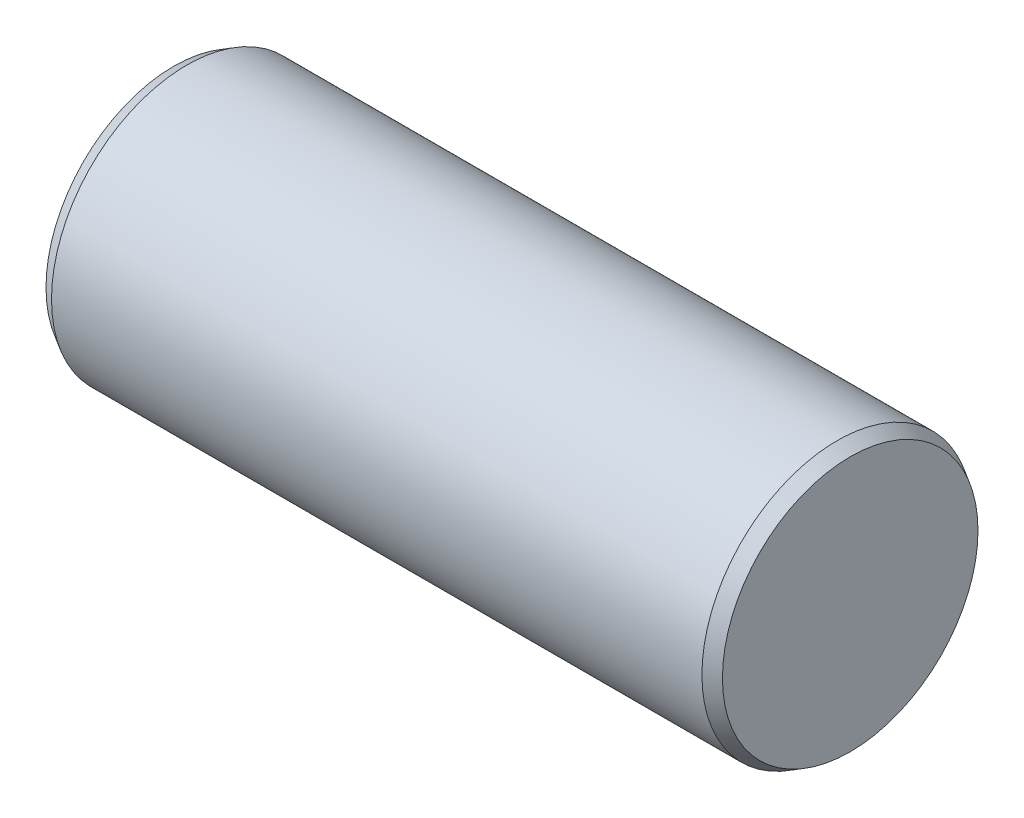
from build123d import *
from OCP.BRepFilletAPI import BRepFilletAPI_MakeChamfer

# Parameters (mm, degrees)
ESQUISSE1_R        = 9
BOSS_EXTRU_1_DEPTH = 22.5
CHANFREIN1_SIZE    = 0.5
CHANFREIN1_SIZE2   = 0.866025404


with BuildPart() as part:
    # Esquisse1 → Boss.-Extru.1 (new, symmetric)
    with BuildSketch(Plane(origin=(0, 0, 0), x_dir=(0, 0, -1), z_dir=(1, 0, 0))):
        with Locations(Location((0, 0, 0), (0, 0, 180))):
            Circle(ESQUISSE1_R)
    extrude(amount=BOSS_EXTRU_1_DEPTH, both=True)

    # Chanfrein1: one chamfer whose edges measure the first distance from different faces: ONE call of the kernel's chamfer builder (chamfer() names one face for all edges)
    chanfrein1_edges_1 = [part.edges().sort_by_distance(p)[0] for p in [
        (-22.5, 0, -9),
    ]]
    chanfrein1_side_1 = [part.faces().sort_by_distance(p)[0] for p in [
        (-22.5, 0, 0),
    ]]
    chanfrein1_edges_2 = [part.edges().sort_by_distance(p)[0] for p in [
        (22.5, 0, -9),
    ]]
    chanfrein1_side_2 = [part.faces().sort_by_distance(p)[0] for p in [
        (22.5, 0, 0),
    ]]
    chanfrein1 = BRepFilletAPI_MakeChamfer(part.part.solid().wrapped)
    for e in chanfrein1_edges_1:
        chanfrein1.Add(CHANFREIN1_SIZE, CHANFREIN1_SIZE2, e.wrapped, chanfrein1_side_1[0].wrapped)  # the first distance lies on this face
    for e in chanfrein1_edges_2:
        chanfrein1.Add(CHANFREIN1_SIZE, CHANFREIN1_SIZE2, e.wrapped, chanfrein1_side_2[0].wrapped)  # the first distance lies on this face
    add(Compound.cast(chanfrein1.Shape()), mode=Mode.REPLACE)


solid = part.part
